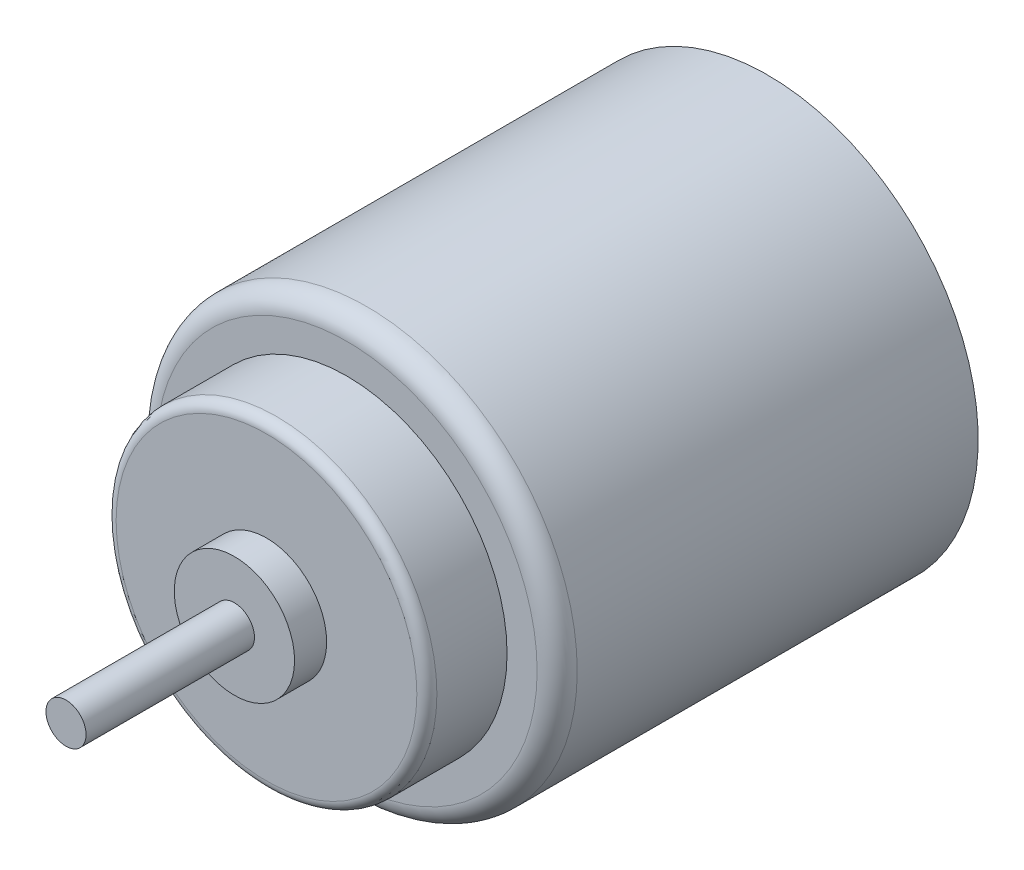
from build123d import *

# Parameters (mm, degrees)
CROQUIS1_R              = 10.5
SALIENTE_EXTRUIR1_DEPTH = 21
CROQUIS2_R              = 8
SALIENTE_EXTRUIR2_DEPTH = 4
CROQUIS3_R              = 3
SALIENTE_EXTRUIR3_DEPTH = 1.6
CROQUIS4_R              = 1
SALIENTE_EXTRUIR4_DEPTH = 8.4
REDONDEO1_R             = 1
REDONDEO2_R             = 0.5
SALIENTE_EXTRUIR5_START = 2
CROQUIS5_R              = 3
SALIENTE_EXTRUIR5_DEPTH = 2
REDONDEO3_R             = 0.5


with BuildPart() as part:
    # Croquis1 → Saliente-Extruir1 (new body)
    with BuildSketch(Plane.XY):
        with Locations(Location((0, 0, 0), (0, 0, 180))):
            Circle(CROQUIS1_R)
    extrude(amount=SALIENTE_EXTRUIR1_DEPTH)

    # Croquis2 → Saliente-Extruir2 (add)
    with BuildSketch(Plane.XY.offset(21)):
        Circle(CROQUIS2_R)
    extrude(amount=SALIENTE_EXTRUIR2_DEPTH)

    # Croquis3 → Saliente-Extruir3 (add)
    with BuildSketch(Plane.XY.offset(25)):
        Circle(CROQUIS3_R)
    extrude(amount=SALIENTE_EXTRUIR3_DEPTH)

    # Croquis4 → Saliente-Extruir4 (add)
    with BuildSketch(Plane.XY.offset(26.6)):
        Circle(CROQUIS4_R)
    extrude(amount=SALIENTE_EXTRUIR4_DEPTH)

    # Redondeo1
    redondeo1_edges = [part.edges().sort_by_distance(p)[0] for p in [
        (10.5, 0, 21),
    ]]
    fillet(redondeo1_edges, radius=REDONDEO1_R)

    # Redondeo2
    redondeo2_edges = [part.edges().sort_by_distance(p)[0] for p in [
        (-8, 0, 25),
    ]]
    fillet(redondeo2_edges, radius=REDONDEO2_R)

    # Croquis5 → Saliente-Extruir5 (add)
    with BuildSketch(Plane(origin=(0, 0, 0), x_dir=(-1, 0, 0), z_dir=(0, 0, -1)).offset(SALIENTE_EXTRUIR5_START)):
        with Locations(Location((0, 0, 0), (0, 0, 180))):
            Circle(CROQUIS5_R)
    extrude(amount=-SALIENTE_EXTRUIR5_DEPTH)

    # Redondeo3
    redondeo3_edges = [part.edges().sort_by_distance(p)[0] for p in [
        (-3, 0, -2),
    ]]
    fillet(redondeo3_edges, radius=REDONDEO3_R)


solid = part.part
